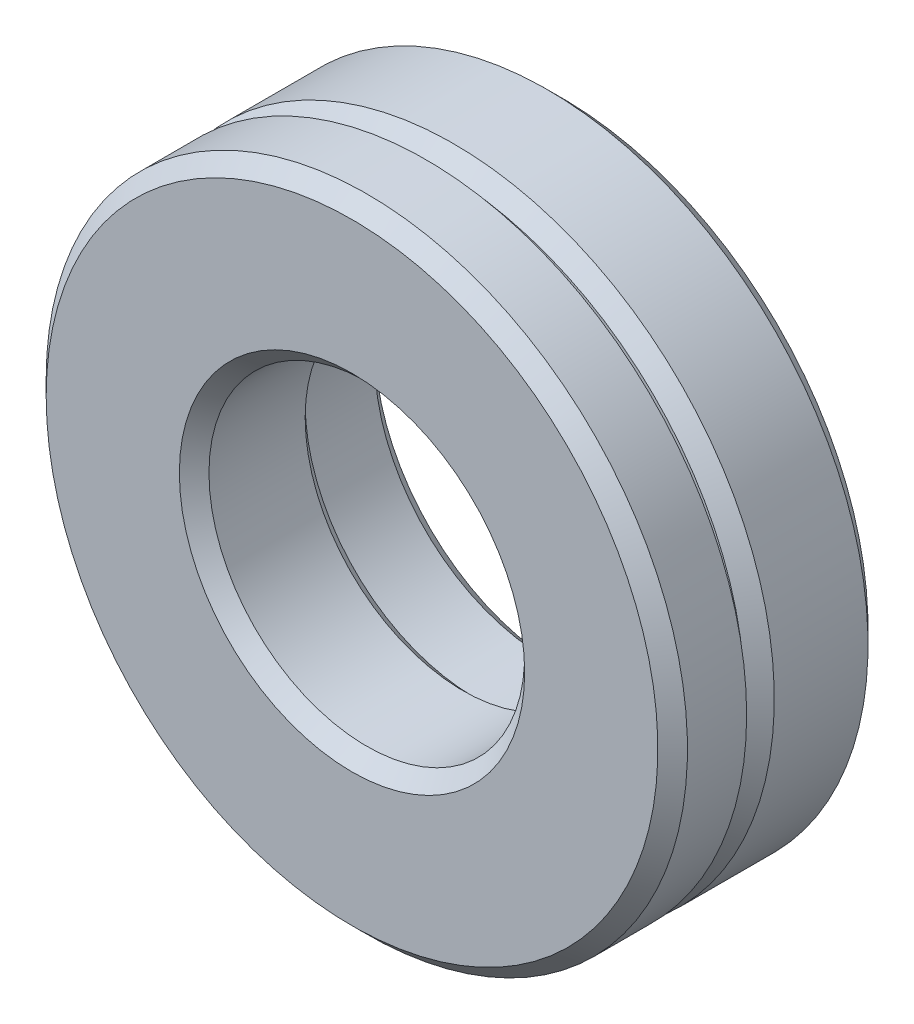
ISO-10303-21;
HEADER;
FILE_DESCRIPTION(('STEP AP214'),'2;1');
FILE_NAME('part.step','',(''),(''),'','','');
FILE_SCHEMA(('AUTOMOTIVE_DESIGN { 1 0 10303 214 1 1 1 1 }'));
ENDSEC;
DATA;
#1=APPLICATION_CONTEXT('core data for automotive mechanical design processes');
#2=APPLICATION_PROTOCOL_DEFINITION('international standard','automotive_design',2000,#1);
#3=PRODUCT_CONTEXT('',#1,'mechanical');
#4=PRODUCT('Part','Part','',(#3));
#5=PRODUCT_RELATED_PRODUCT_CATEGORY('part','',(#4));
#6=PRODUCT_DEFINITION_FORMATION('','',#4);
#7=PRODUCT_DEFINITION_CONTEXT('part definition',#1,'design');
#8=PRODUCT_DEFINITION('design','',#6,#7);
#9=PRODUCT_DEFINITION_SHAPE('','',#8);
#10=(LENGTH_UNIT() NAMED_UNIT(*) SI_UNIT(.MILLI.,.METRE.));
#11=(NAMED_UNIT(*) PLANE_ANGLE_UNIT() SI_UNIT($,.RADIAN.));
#12=(NAMED_UNIT(*) SI_UNIT($,.STERADIAN.) SOLID_ANGLE_UNIT());
#13=UNCERTAINTY_MEASURE_WITH_UNIT(LENGTH_MEASURE(1.E-05),#10,'distance_accuracy_value','');
#14=(GEOMETRIC_REPRESENTATION_CONTEXT(3) GLOBAL_UNCERTAINTY_ASSIGNED_CONTEXT((#13)) GLOBAL_UNIT_ASSIGNED_CONTEXT((#10,
#11,#12)) REPRESENTATION_CONTEXT('',''));
#15=CARTESIAN_POINT('',(0.,0.,0.));
#16=DIRECTION('',(0.,0.,1.));
#17=DIRECTION('',(1.,0.,0.));
#18=AXIS2_PLACEMENT_3D('',#15,#16,#17);
#19=CARTESIAN_POINT('',(0.,0.,6.76033934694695));
#20=DIRECTION('',(0.,0.,1.));
#21=DIRECTION('',(-1.,0.,0.));
#22=AXIS2_PLACEMENT_3D('',#19,#20,#21);
#23=CYLINDRICAL_SURFACE('',#22,3.5);
#24=CARTESIAN_POINT('',(0.,0.,0.299999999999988));
#25=DIRECTION('',(0.,0.,1.));
#26=DIRECTION('',(-1.,0.,0.));
#27=AXIS2_PLACEMENT_3D('',#24,#25,#26);
#28=CIRCLE('',#27,3.49999999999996);
#29=CARTESIAN_POINT('',(-3.49999999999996,0.,0.299999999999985));
#30=VERTEX_POINT('',#29);
#31=EDGE_CURVE('E23',#30,#30,#28,.T.);
#32=ORIENTED_EDGE('',*,*,#31,.F.);
#33=EDGE_LOOP('',(#32));
#34=FACE_BOUND('',#33,.T.);
#35=CARTESIAN_POINT('',(0.,0.,1.76033934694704));
#36=DIRECTION('',(0.,0.,1.));
#37=DIRECTION('',(-1.,0.,0.));
#38=AXIS2_PLACEMENT_3D('',#35,#36,#37);
#39=CIRCLE('',#38,3.5);
#40=CARTESIAN_POINT('',(-3.50000000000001,0.,1.76033934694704));
#41=VERTEX_POINT('',#40);
#42=EDGE_CURVE('E32',#41,#41,#39,.T.);
#43=ORIENTED_EDGE('',*,*,#42,.T.);
#44=EDGE_LOOP('',(#43));
#45=FACE_BOUND('',#44,.T.);
#46=ADVANCED_FACE('F12',(#34,#45),#23,.F.);
#47=CARTESIAN_POINT('',(0.,0.,0.299999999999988));
#48=DIRECTION('',(0.,0.,-1.));
#49=DIRECTION('',(1.,0.,0.));
#50=AXIS2_PLACEMENT_3D('',#47,#48,#49);
#51=CONICAL_SURFACE('',#50,3.49999999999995,0.785398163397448);
#52=CARTESIAN_POINT('',(0.,0.,0.));
#53=DIRECTION('',(0.,0.,1.));
#54=DIRECTION('',(-1.,0.,0.));
#55=AXIS2_PLACEMENT_3D('',#52,#53,#54);
#56=CIRCLE('',#55,3.79999999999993);
#57=CARTESIAN_POINT('',(-3.79999999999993,0.,0.));
#58=VERTEX_POINT('',#57);
#59=EDGE_CURVE('E27',#58,#58,#56,.T.);
#60=ORIENTED_EDGE('',*,*,#59,.F.);
#61=EDGE_LOOP('',(#60));
#62=FACE_BOUND('',#61,.T.);
#63=ORIENTED_EDGE('',*,*,#31,.T.);
#64=EDGE_LOOP('',(#63));
#65=FACE_BOUND('',#64,.T.);
#66=ADVANCED_FACE('F86',(#62,#65),#51,.F.);
#67=CARTESIAN_POINT('',(6.19999999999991,0.,0.));
#68=DIRECTION('',(0.,0.,1.));
#69=DIRECTION('',(-1.,0.,0.));
#70=AXIS2_PLACEMENT_3D('',#67,#68,#69);
#71=PLANE('',#70);
#72=CARTESIAN_POINT('',(0.,0.,0.));
#73=DIRECTION('',(0.,0.,1.));
#74=DIRECTION('',(-1.,0.,0.));
#75=AXIS2_PLACEMENT_3D('',#72,#73,#74);
#76=CIRCLE('',#75,6.19999999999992);
#77=CARTESIAN_POINT('',(-6.19999999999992,0.,0.));
#78=VERTEX_POINT('',#77);
#79=EDGE_CURVE('E36',#78,#78,#76,.T.);
#80=ORIENTED_EDGE('',*,*,#79,.F.);
#81=EDGE_LOOP('',(#80));
#82=FACE_BOUND('',#81,.T.);
#83=ORIENTED_EDGE('',*,*,#59,.T.);
#84=EDGE_LOOP('',(#83));
#85=FACE_BOUND('',#84,.T.);
#86=ADVANCED_FACE('F91',(#82,#85),#71,.F.);
#87=CARTESIAN_POINT('',(0.,0.,0.));
#88=DIRECTION('',(0.,0.,1.));
#89=DIRECTION('',(-1.,0.,0.));
#90=AXIS2_PLACEMENT_3D('',#87,#88,#89);
#91=CONICAL_SURFACE('',#90,6.19999999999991,0.785398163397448);
#92=CARTESIAN_POINT('',(0.,0.,0.299999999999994));
#93=DIRECTION('',(0.,0.,1.));
#94=DIRECTION('',(-1.,0.,0.));
#95=AXIS2_PLACEMENT_3D('',#92,#93,#94);
#96=CIRCLE('',#95,6.4999999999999);
#97=CARTESIAN_POINT('',(-6.4999999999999,0.,0.299999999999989));
#98=VERTEX_POINT('',#97);
#99=EDGE_CURVE('E39',#98,#98,#96,.T.);
#100=ORIENTED_EDGE('',*,*,#99,.F.);
#101=EDGE_LOOP('',(#100));
#102=FACE_BOUND('',#101,.T.);
#103=ORIENTED_EDGE('',*,*,#79,.T.);
#104=EDGE_LOOP('',(#103));
#105=FACE_BOUND('',#104,.T.);
#106=ADVANCED_FACE('F98',(#102,#105),#91,.T.);
#107=CARTESIAN_POINT('',(0.,0.,6.76033934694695));
#108=DIRECTION('',(0.,0.,1.));
#109=DIRECTION('',(-1.,0.,0.));
#110=AXIS2_PLACEMENT_3D('',#107,#108,#109);
#111=CYLINDRICAL_SURFACE('',#110,6.4999999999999);
#112=CARTESIAN_POINT('',(0.,0.,2.19999999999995));
#113=DIRECTION('',(0.,0.,1.));
#114=DIRECTION('',(-1.,0.,0.));
#115=AXIS2_PLACEMENT_3D('',#112,#113,#114);
#116=CIRCLE('',#115,6.4999999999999);
#117=CARTESIAN_POINT('',(-6.49999999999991,0.,2.19999999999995));
#118=VERTEX_POINT('',#117);
#119=EDGE_CURVE('E42',#118,#118,#116,.T.);
#120=ORIENTED_EDGE('',*,*,#119,.F.);
#121=EDGE_LOOP('',(#120));
#122=FACE_BOUND('',#121,.T.);
#123=ORIENTED_EDGE('',*,*,#99,.T.);
#124=EDGE_LOOP('',(#123));
#125=FACE_BOUND('',#124,.T.);
#126=ADVANCED_FACE('F102',(#122,#125),#111,.T.);
#127=CARTESIAN_POINT('',(0.,0.,2.19999999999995));
#128=DIRECTION('',(0.,0.,-1.));
#129=DIRECTION('',(1.,0.,0.));
#130=AXIS2_PLACEMENT_3D('',#127,#128,#129);
#131=CONICAL_SURFACE('',#130,6.4999999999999,0.785398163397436);
#132=CARTESIAN_POINT('',(0.,0.,2.49999999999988));
#133=DIRECTION('',(0.,0.,1.));
#134=DIRECTION('',(-1.,0.,0.));
#135=AXIS2_PLACEMENT_3D('',#132,#133,#134);
#136=CIRCLE('',#135,6.2);
#137=CARTESIAN_POINT('',(-6.20000000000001,0.,2.49999999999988));
#138=VERTEX_POINT('',#137);
#139=EDGE_CURVE('E45',#138,#138,#136,.T.);
#140=ORIENTED_EDGE('',*,*,#139,.F.);
#141=EDGE_LOOP('',(#140));
#142=FACE_BOUND('',#141,.T.);
#143=ORIENTED_EDGE('',*,*,#119,.T.);
#144=EDGE_LOOP('',(#143));
#145=FACE_BOUND('',#144,.T.);
#146=ADVANCED_FACE('F106',(#142,#145),#131,.T.);
#147=CARTESIAN_POINT('',(5.92818905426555,0.,2.49999999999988));
#148=DIRECTION('',(0.,0.,-1.));
#149=DIRECTION('',(1.,0.,0.));
#150=AXIS2_PLACEMENT_3D('',#147,#148,#149);
#151=PLANE('',#150);
#152=CARTESIAN_POINT('',(0.,0.,2.49999999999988));
#153=DIRECTION('',(0.,0.,1.));
#154=DIRECTION('',(-1.,0.,0.));
#155=AXIS2_PLACEMENT_3D('',#152,#153,#154);
#156=CIRCLE('',#155,5.92818905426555);
#157=CARTESIAN_POINT('',(5.92818905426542,0.,2.49999999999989));
#158=VERTEX_POINT('',#157);
#159=EDGE_CURVE('E48',#158,#158,#156,.T.);
#160=ORIENTED_EDGE('',*,*,#159,.F.);
#161=EDGE_LOOP('',(#160));
#162=FACE_BOUND('',#161,.T.);
#163=ORIENTED_EDGE('',*,*,#139,.T.);
#164=EDGE_LOOP('',(#163));
#165=FACE_BOUND('',#164,.T.);
#166=ADVANCED_FACE('F110',(#162,#165),#151,.F.);
#167=CARTESIAN_POINT('',(1.56819002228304E-12,0.,16.278845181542));
#168=DIRECTION('',(0.,0.,1.));
#169=DIRECTION('',(1.,0.,0.));
#170=AXIS2_PLACEMENT_3D('',#167,#168,#169);
#171=SPHERICAL_SURFACE('',#170,15.);
#172=CARTESIAN_POINT('',(0.,0.,2.76033934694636));
#173=DIRECTION('',(0.,0.,1.));
#174=DIRECTION('',(-1.,0.,0.));
#175=AXIS2_PLACEMENT_3D('',#172,#173,#174);
#176=CIRCLE('',#175,6.50000000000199);
#177=CARTESIAN_POINT('',(6.50000000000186,0.,2.76033934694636));
#178=VERTEX_POINT('',#177);
#179=EDGE_CURVE('E51',#178,#178,#176,.T.);
#180=CARTESIAN_POINT('',(6.50000000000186,0.,2.76033934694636));
#181=CARTESIAN_POINT('',(6.4941013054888,0.,2.75750312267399));
#182=CARTESIAN_POINT('',(6.48820075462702,0.,2.75467075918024));
#183=CARTESIAN_POINT('',(6.4763959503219,0.,2.749013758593));
#184=CARTESIAN_POINT('',(6.47049169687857,0.,2.74618912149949));
#185=CARTESIAN_POINT('',(6.45867949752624,0.,2.74054757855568));
#186=CARTESIAN_POINT('',(6.45277155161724,0.,2.73773067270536));
#187=CARTESIAN_POINT('',(6.44095197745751,0.,2.73210459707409));
#188=CARTESIAN_POINT('',(6.43504034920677,0.,2.72929542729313));
#189=CARTESIAN_POINT('',(6.42321342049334,0.,2.72368482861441));
#190=CARTESIAN_POINT('',(6.41729812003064,0.,2.72088339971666));
#191=CARTESIAN_POINT('',(6.40546385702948,0.,2.7152882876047));
#192=CARTESIAN_POINT('',(6.39954489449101,0.,2.71249460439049));
#193=CARTESIAN_POINT('',(6.38770331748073,0.,2.70691498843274));
#194=CARTESIAN_POINT('',(6.38178070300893,0.,2.7041290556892));
#195=CARTESIAN_POINT('',(6.36993183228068,0.,2.69856494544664));
#196=CARTESIAN_POINT('',(6.36400557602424,0.,2.69578676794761));
#197=CARTESIAN_POINT('',(6.35214943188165,0.,2.6902381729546));
#198=CARTESIAN_POINT('',(6.34621954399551,0.,2.68746775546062));
#199=CARTESIAN_POINT('',(6.33435614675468,0.,2.68193468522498));
#200=CARTESIAN_POINT('',(6.3284226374,0.,2.6791720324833));
#201=CARTESIAN_POINT('',(6.31655200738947,0.,2.67365449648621));
#202=CARTESIAN_POINT('',(6.31061488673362,0.,2.67089961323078));
#203=CARTESIAN_POINT('',(6.2987370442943,0.,2.66539762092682));
#204=CARTESIAN_POINT('',(6.29279632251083,0.,2.66265051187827));
#205=CARTESIAN_POINT('',(6.28091128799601,0.,2.65716407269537));
#206=CARTESIAN_POINT('',(6.27496697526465,0.,2.65442474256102));
#207=CARTESIAN_POINT('',(6.26307476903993,0.,2.64895386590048));
#208=CARTESIAN_POINT('',(6.25712687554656,0.,2.64622231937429));
#209=CARTESIAN_POINT('',(6.24522751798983,0.,2.64076701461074));
#210=CARTESIAN_POINT('',(6.23927605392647,0.,2.63804325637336));
#211=CARTESIAN_POINT('',(6.22736956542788,0.,2.63260353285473));
#212=CARTESIAN_POINT('',(6.22141454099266,0.,2.62988756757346));
#213=CARTESIAN_POINT('',(6.20950094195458,0.,2.62446343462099));
#214=CARTESIAN_POINT('',(6.20354236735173,0.,2.62175526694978));
#215=CARTESIAN_POINT('',(6.19162167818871,0.,2.61634673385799));
#216=CARTESIAN_POINT('',(6.18565956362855,0.,2.61364636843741));
#217=CARTESIAN_POINT('',(6.1737318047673,0.,2.6082534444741));
#218=CARTESIAN_POINT('',(6.16776616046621,0.,2.60556088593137));
#219=CARTESIAN_POINT('',(6.15583135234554,0.,2.60018358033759));
#220=CARTESIAN_POINT('',(6.14986218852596,0.,2.59749883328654));
#221=CARTESIAN_POINT('',(6.13792035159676,0.,2.59213715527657));
#222=CARTESIAN_POINT('',(6.13194767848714,0.,2.58946022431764));
#223=CARTESIAN_POINT('',(6.11999883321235,0.,2.58411418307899));
#224=CARTESIAN_POINT('',(6.11402266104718,0.,2.58144507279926));
#225=CARTESIAN_POINT('',(6.10206682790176,0.,2.57611467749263));
#226=CARTESIAN_POINT('',(6.0960871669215,0.,2.57345339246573));
#227=CARTESIAN_POINT('',(6.08412436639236,0.,2.56813865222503));
#228=CARTESIAN_POINT('',(6.07814122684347,0.,2.56548519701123));
#229=CARTESIAN_POINT('',(6.06617147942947,0.,2.56018612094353));
#230=CARTESIAN_POINT('',(6.06018487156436,0.,2.55754050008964));
#231=CARTESIAN_POINT('',(6.04820819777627,0.,2.55225709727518));
#232=CARTESIAN_POINT('',(6.04221813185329,0.,2.5496193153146));
#233=CARTESIAN_POINT('',(6.03023455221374,0.,2.54435159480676));
#234=CARTESIAN_POINT('',(6.02424103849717,0.,2.54172165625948));
#235=CARTESIAN_POINT('',(6.01225057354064,0.,2.53646962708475));
#236=CARTESIAN_POINT('',(6.00625362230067,0.,2.53384753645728));
#237=CARTESIAN_POINT('',(5.99425629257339,0.,2.52861120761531));
#238=CARTESIAN_POINT('',(5.98825591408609,0.,2.5259969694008));
#239=CARTESIAN_POINT('',(5.97625174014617,0.,2.52077634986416));
#240=CARTESIAN_POINT('',(5.97024794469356,0.,2.51816996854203));
#241=CARTESIAN_POINT('',(5.95823694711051,0.,2.51296506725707));
#242=CARTESIAN_POINT('',(5.95222974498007,0.,2.51036654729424));
#243=CARTESIAN_POINT('',(5.94021194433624,0.,2.50517737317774));
#244=CARTESIAN_POINT('',(5.93420134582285,0.,2.50258671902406));
#245=CARTESIAN_POINT('',(5.92818905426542,0.,2.49999999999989));
#246=B_SPLINE_CURVE_WITH_KNOTS('',3,(#180,#181,#182,#183,#184,#185,#186,#187,#188,#189,#190,
#191,#192,#193,#194,#195,#196,#197,#198,#199,#200,#201,#202,#203,#204,#205,#206,#207,#208,#209,
#210,#211,#212,#213,#214,#215,#216,#217,#218,#219,#220,#221,#222,#223,#224,#225,#226,#227,#228,
#229,#230,#231,#232,#233,#234,#235,#236,#237,#238,#239,#240,#241,#242,#243,#244,#245),
.UNSPECIFIED.,.F.,.F.,(4,2,2,2,2,2,2,2,2,2,2,2,2,2,2,2,2,2,2,2,2,2,2,2,2,2,2,2,2,2,2,2,4),(0.,
0.0196353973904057,0.0392707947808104,0.058906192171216,0.0785415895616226,0.0981769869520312,
0.117812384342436,0.137447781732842,0.157083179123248,0.176718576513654,0.196353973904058,
0.215989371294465,0.235624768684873,0.255260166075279,0.274895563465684,0.294530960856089,
0.314166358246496,0.3338017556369,0.353437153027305,0.373072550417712,0.392707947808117,
0.412343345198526,0.431978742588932,0.451614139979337,0.471249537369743,0.490884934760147,
0.510520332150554,0.530155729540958,0.549791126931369,0.569426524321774,0.58906192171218,
0.608697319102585,0.628332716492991),.UNSPECIFIED.);
#247=EDGE_CURVE('BSEAM114',#178,#158,#246,.T.);
#248=ORIENTED_EDGE('',*,*,#179,.F.);
#249=ORIENTED_EDGE('',*,*,#159,.T.);
#250=ORIENTED_EDGE('',*,*,#247,.T.);
#251=ORIENTED_EDGE('',*,*,#247,.F.);
#252=EDGE_LOOP('',(#248,#250,#249,#251));
#253=FACE_BOUND('',#252,.T.);
#254=ADVANCED_FACE('F114',(#253),#171,.T.);
#255=CARTESIAN_POINT('',(0.,0.,6.76033934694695));
#256=DIRECTION('',(0.,0.,1.));
#257=DIRECTION('',(-1.,0.,0.));
#258=AXIS2_PLACEMENT_3D('',#255,#256,#257);
#259=CYLINDRICAL_SURFACE('',#258,6.50000000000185);
#260=CARTESIAN_POINT('',(0.,0.,3.96033934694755));
#261=DIRECTION('',(0.,0.,1.));
#262=DIRECTION('',(-1.,0.,0.));
#263=AXIS2_PLACEMENT_3D('',#260,#261,#262);
#264=CIRCLE('',#263,6.50000000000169);
#265=CARTESIAN_POINT('',(-6.5000000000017,0.,3.96033934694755));
#266=VERTEX_POINT('',#265);
#267=EDGE_CURVE('E54',#266,#266,#264,.T.);
#268=ORIENTED_EDGE('',*,*,#267,.F.);
#269=EDGE_LOOP('',(#268));
#270=FACE_BOUND('',#269,.T.);
#271=ORIENTED_EDGE('',*,*,#179,.T.);
#272=EDGE_LOOP('',(#271));
#273=FACE_BOUND('',#272,.T.);
#274=ADVANCED_FACE('F118',(#270,#273),#259,.T.);
#275=CARTESIAN_POINT('',(0.,0.,3.96033934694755));
#276=DIRECTION('',(0.,0.,-1.));
#277=DIRECTION('',(1.,0.,0.));
#278=AXIS2_PLACEMENT_3D('',#275,#276,#277);
#279=CONICAL_SURFACE('',#278,6.5000000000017,0.785398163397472);
#280=CARTESIAN_POINT('',(0.,0.,4.26033934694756));
#281=DIRECTION('',(0.,0.,1.));
#282=DIRECTION('',(-1.,0.,0.));
#283=AXIS2_PLACEMENT_3D('',#280,#281,#282);
#284=CIRCLE('',#283,6.20000000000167);
#285=CARTESIAN_POINT('',(-6.20000000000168,0.,4.26033934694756));
#286=VERTEX_POINT('',#285);
#287=EDGE_CURVE('E57',#286,#286,#284,.T.);
#288=ORIENTED_EDGE('',*,*,#287,.F.);
#289=EDGE_LOOP('',(#288));
#290=FACE_BOUND('',#289,.T.);
#291=ORIENTED_EDGE('',*,*,#267,.T.);
#292=EDGE_LOOP('',(#291));
#293=FACE_BOUND('',#292,.T.);
#294=ADVANCED_FACE('F83',(#290,#293),#279,.T.);
#295=CARTESIAN_POINT('',(3.45,0.,4.26033934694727));
#296=DIRECTION('',(0.,0.,-1.));
#297=DIRECTION('',(1.,0.,0.));
#298=AXIS2_PLACEMENT_3D('',#295,#296,#297);
#299=PLANE('',#298);
#300=CARTESIAN_POINT('',(0.,0.,4.26033934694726));
#301=DIRECTION('',(0.,0.,-1.));
#302=DIRECTION('',(-1.,0.,0.));
#303=AXIS2_PLACEMENT_3D('',#300,#301,#302);
#304=CIRCLE('',#303,3.49999999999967);
#305=CARTESIAN_POINT('',(-3.49999999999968,0.,4.26033934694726));
#306=VERTEX_POINT('',#305);
#307=EDGE_CURVE('E8',#306,#306,#304,.T.);
#308=ORIENTED_EDGE('',*,*,#307,.T.);
#309=EDGE_LOOP('',(#308));
#310=FACE_BOUND('',#309,.T.);
#311=ORIENTED_EDGE('',*,*,#287,.T.);
#312=EDGE_LOOP('',(#311));
#313=FACE_BOUND('',#312,.T.);
#314=ADVANCED_FACE('F76',(#310,#313),#299,.F.);
#315=CARTESIAN_POINT('',(0.,0.,2.06033934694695));
#316=DIRECTION('',(0.,0.,-1.));
#317=DIRECTION('',(1.,0.,0.));
#318=AXIS2_PLACEMENT_3D('',#315,#316,#317);
#319=CONICAL_SURFACE('',#318,3.15,0.78539816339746);
#320=CARTESIAN_POINT('',(0.,0.,2.01033934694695));
#321=DIRECTION('',(0.,0.,-1.));
#322=DIRECTION('',(-1.,0.,0.));
#323=AXIS2_PLACEMENT_3D('',#320,#321,#322);
#324=CIRCLE('',#323,3.2);
#325=CARTESIAN_POINT('',(-3.20000000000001,0.,2.01033934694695));
#326=VERTEX_POINT('',#325);
#327=EDGE_CURVE('E30',#326,#326,#324,.F.);
#328=ORIENTED_EDGE('',*,*,#327,.T.);
#329=EDGE_LOOP('',(#328));
#330=FACE_BOUND('',#329,.T.);
#331=CARTESIAN_POINT('',(0.,0.,1.76033934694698));
#332=DIRECTION('',(0.,0.,1.));
#333=DIRECTION('',(-1.,0.,0.));
#334=AXIS2_PLACEMENT_3D('',#331,#332,#333);
#335=CIRCLE('',#334,3.45);
#336=CARTESIAN_POINT('',(-3.45000000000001,0.,1.76033934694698));
#337=VERTEX_POINT('',#336);
#338=EDGE_CURVE('E60',#337,#337,#335,.T.);
#339=ORIENTED_EDGE('',*,*,#338,.F.);
#340=EDGE_LOOP('',(#339));
#341=FACE_BOUND('',#340,.T.);
#342=ADVANCED_FACE('F71',(#330,#341),#319,.F.);
#343=CARTESIAN_POINT('',(3.5,0.,1.76033934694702));
#344=DIRECTION('',(0.,0.,1.));
#345=DIRECTION('',(-1.,0.,0.));
#346=AXIS2_PLACEMENT_3D('',#343,#344,#345);
#347=PLANE('',#346);
#348=ORIENTED_EDGE('',*,*,#42,.F.);
#349=EDGE_LOOP('',(#348));
#350=FACE_BOUND('',#349,.T.);
#351=ORIENTED_EDGE('',*,*,#338,.T.);
#352=EDGE_LOOP('',(#351));
#353=FACE_BOUND('',#352,.T.);
#354=ADVANCED_FACE('F67',(#350,#353),#347,.F.);
#355=CARTESIAN_POINT('',(0.,0.,-5.73966065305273));
#356=DIRECTION('',(0.,0.,1.));
#357=DIRECTION('',(1.,0.,0.));
#358=AXIS2_PLACEMENT_3D('',#355,#356,#357);
#359=CYLINDRICAL_SURFACE('',#358,3.2);
#360=CARTESIAN_POINT('',(0.,0.,3.9603393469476));
#361=DIRECTION('',(0.,0.,-1.));
#362=DIRECTION('',(-1.,0.,0.));
#363=AXIS2_PLACEMENT_3D('',#360,#361,#362);
#364=CIRCLE('',#363,3.2);
#365=CARTESIAN_POINT('',(-3.20000000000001,0.,3.9603393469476));
#366=VERTEX_POINT('',#365);
#367=EDGE_CURVE('E19',#366,#366,#364,.F.);
#368=ORIENTED_EDGE('',*,*,#367,.T.);
#369=EDGE_LOOP('',(#368));
#370=FACE_BOUND('',#369,.T.);
#371=ORIENTED_EDGE('',*,*,#327,.F.);
#372=EDGE_LOOP('',(#371));
#373=FACE_BOUND('',#372,.T.);
#374=ADVANCED_FACE('F70',(#370,#373),#359,.F.);
#375=CARTESIAN_POINT('',(0.,0.,3.9603393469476));
#376=DIRECTION('',(0.,0.,1.));
#377=DIRECTION('',(1.,0.,0.));
#378=AXIS2_PLACEMENT_3D('',#375,#376,#377);
#379=CONICAL_SURFACE('',#378,3.2,0.78539816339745);
#380=ORIENTED_EDGE('',*,*,#307,.F.);
#381=EDGE_LOOP('',(#380));
#382=FACE_BOUND('',#381,.T.);
#383=ORIENTED_EDGE('',*,*,#367,.F.);
#384=EDGE_LOOP('',(#383));
#385=FACE_BOUND('',#384,.T.);
#386=ADVANCED_FACE('F14',(#382,#385),#379,.F.);
#387=CLOSED_SHELL('',(#46,#66,#86,#106,#126,#146,#166,#254,#274,#294,#314,#342,#354,#374,#386));
#388=MANIFOLD_SOLID_BREP('B1',#387);
#389=ADVANCED_BREP_SHAPE_REPRESENTATION('',(#18,#388),#14);
#390=SHAPE_DEFINITION_REPRESENTATION(#9,#389);
ENDSEC;
END-ISO-10303-21;
